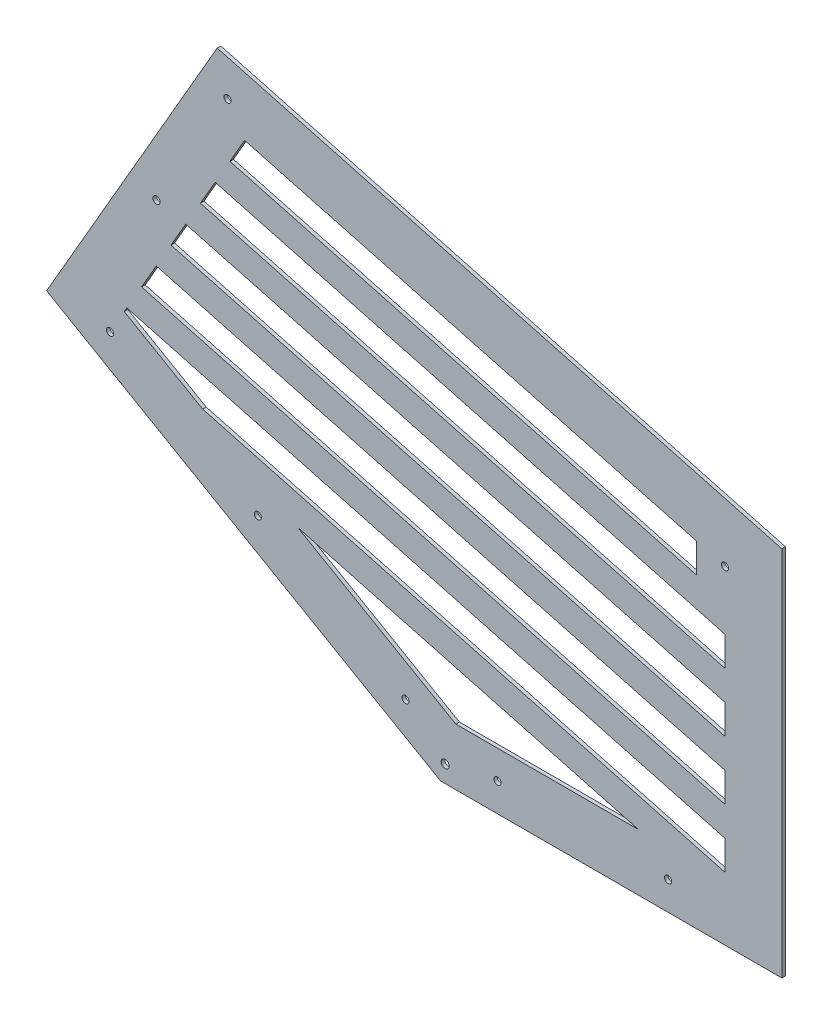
ISO-10303-21;
HEADER;
FILE_DESCRIPTION(('STEP AP214'),'2;1');
FILE_NAME('part.step','',(''),(''),'','','');
FILE_SCHEMA(('AUTOMOTIVE_DESIGN { 1 0 10303 214 1 1 1 1 }'));
ENDSEC;
DATA;
#1=APPLICATION_CONTEXT('core data for automotive mechanical design processes');
#2=APPLICATION_PROTOCOL_DEFINITION('international standard','automotive_design',2000,#1);
#3=PRODUCT_CONTEXT('',#1,'mechanical');
#4=PRODUCT('Part','Part','',(#3));
#5=PRODUCT_RELATED_PRODUCT_CATEGORY('part','',(#4));
#6=PRODUCT_DEFINITION_FORMATION('','',#4);
#7=PRODUCT_DEFINITION_CONTEXT('part definition',#1,'design');
#8=PRODUCT_DEFINITION('design','',#6,#7);
#9=PRODUCT_DEFINITION_SHAPE('','',#8);
#10=(LENGTH_UNIT() NAMED_UNIT(*) SI_UNIT(.MILLI.,.METRE.));
#11=(NAMED_UNIT(*) PLANE_ANGLE_UNIT() SI_UNIT($,.RADIAN.));
#12=(NAMED_UNIT(*) SI_UNIT($,.STERADIAN.) SOLID_ANGLE_UNIT());
#13=UNCERTAINTY_MEASURE_WITH_UNIT(LENGTH_MEASURE(1.E-05),#10,'distance_accuracy_value','');
#14=(GEOMETRIC_REPRESENTATION_CONTEXT(3) GLOBAL_UNCERTAINTY_ASSIGNED_CONTEXT((#13)) GLOBAL_UNIT_ASSIGNED_CONTEXT((#10,
#11,#12)) REPRESENTATION_CONTEXT('',''));
#15=CARTESIAN_POINT('',(0.,0.,0.));
#16=DIRECTION('',(0.,0.,1.));
#17=DIRECTION('',(1.,0.,0.));
#18=AXIS2_PLACEMENT_3D('',#15,#16,#17);
#19=CARTESIAN_POINT('',(0.,0.,1.5875));
#20=DIRECTION('',(0.,0.,-1.));
#21=DIRECTION('',(-1.,0.,0.));
#22=AXIS2_PLACEMENT_3D('',#19,#20,#21);
#23=PLANE('',#22);
#24=DIRECTION('',(0.,1.,0.));
#25=VECTOR('',#24,1.);
#26=CARTESIAN_POINT('',(127.,80.781676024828,1.5875));
#27=LINE('',#26,#25);
#28=CARTESIAN_POINT('',(127.,80.781676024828,1.5875));
#29=VERTEX_POINT('',#28);
#30=CARTESIAN_POINT('',(127.,93.9296835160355,1.5875));
#31=VERTEX_POINT('',#30);
#32=EDGE_CURVE('E279',#29,#31,#27,.T.);
#33=ORIENTED_EDGE('',*,*,#32,.F.);
#34=DIRECTION('',(0.965925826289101,-0.258819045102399,0.));
#35=VECTOR('',#34,1.);
#36=CARTESIAN_POINT('',(-120.394388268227,147.070802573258,1.5875));
#37=LINE('',#36,#35);
#38=CARTESIAN_POINT('',(-120.394388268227,147.070802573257,1.5875));
#39=VERTEX_POINT('',#38);
#40=EDGE_CURVE('E290',#39,#29,#37,.T.);
#41=ORIENTED_EDGE('',*,*,#40,.F.);
#42=DIRECTION('',(-0.499999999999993,-0.866025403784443,0.));
#43=VECTOR('',#42,1.);
#44=CARTESIAN_POINT('',(-113.820384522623,158.457311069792,1.5875));
#45=LINE('',#44,#43);
#46=CARTESIAN_POINT('',(-113.820384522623,158.457311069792,1.5875));
#47=VERTEX_POINT('',#46);
#48=EDGE_CURVE('E286',#47,#39,#45,.T.);
#49=ORIENTED_EDGE('',*,*,#48,.F.);
#50=DIRECTION('',(-0.965925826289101,0.258819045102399,0.));
#51=VECTOR('',#50,1.);
#52=CARTESIAN_POINT('',(-113.820384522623,158.457311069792,1.5875));
#53=LINE('',#52,#51);
#54=EDGE_CURVE('E282',#31,#47,#53,.T.);
#55=ORIENTED_EDGE('',*,*,#54,.F.);
#56=EDGE_LOOP('',(#33,#41,#49,#55));
#57=FACE_BOUND('',#56,.T.);
#58=CARTESIAN_POINT('',(-126.877839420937,161.241135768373,1.5875));
#59=DIRECTION('',(0.,0.,1.));
#60=DIRECTION('',(1.,0.,0.));
#61=AXIS2_PLACEMENT_3D('',#58,#59,#60);
#62=CIRCLE('',#61,1.58749999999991);
#63=CARTESIAN_POINT('',(-125.290339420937,161.241135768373,1.5875));
#64=VERTEX_POINT('',#63);
#65=EDGE_CURVE('E365',#64,#64,#62,.T.);
#66=ORIENTED_EDGE('',*,*,#65,.F.);
#67=EDGE_LOOP('',(#66));
#68=FACE_BOUND('',#67,.T.);
#69=CARTESIAN_POINT('',(-95.1278394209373,216.233748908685,1.5875));
#70=DIRECTION('',(0.,0.,1.));
#71=DIRECTION('',(1.,0.,0.));
#72=AXIS2_PLACEMENT_3D('',#69,#70,#71);
#73=CIRCLE('',#72,1.58749999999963);
#74=CARTESIAN_POINT('',(-93.5403394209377,216.233748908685,1.5875));
#75=VERTEX_POINT('',#74);
#76=EDGE_CURVE('E373',#75,#75,#73,.T.);
#77=ORIENTED_EDGE('',*,*,#76,.F.);
#78=EDGE_LOOP('',(#77));
#79=FACE_BOUND('',#78,.T.);
#80=CARTESIAN_POINT('',(-15.6470452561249,23.6985226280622,1.5875));
#81=DIRECTION('',(0.,0.,1.));
#82=DIRECTION('',(1.,0.,0.));
#83=AXIS2_PLACEMENT_3D('',#80,#81,#82);
#84=CIRCLE('',#83,1.58749999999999);
#85=CARTESIAN_POINT('',(-14.0595452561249,23.6985226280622,1.5875));
#86=VERTEX_POINT('',#85);
#87=EDGE_CURVE('E381',#86,#86,#84,.T.);
#88=ORIENTED_EDGE('',*,*,#87,.F.);
#89=EDGE_LOOP('',(#88));
#90=FACE_BOUND('',#89,.T.);
#91=CARTESIAN_POINT('',(-81.6381810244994,61.7985226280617,1.5875));
#92=DIRECTION('',(0.,0.,1.));
#93=DIRECTION('',(1.,0.,0.));
#94=AXIS2_PLACEMENT_3D('',#91,#92,#93);
#95=CIRCLE('',#94,1.58750000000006);
#96=CARTESIAN_POINT('',(-80.0506810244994,61.7985226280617,1.5875));
#97=VERTEX_POINT('',#96);
#98=EDGE_CURVE('E389',#97,#97,#95,.T.);
#99=ORIENTED_EDGE('',*,*,#98,.F.);
#100=EDGE_LOOP('',(#99));
#101=FACE_BOUND('',#100,.T.);
#102=CARTESIAN_POINT('',(-147.629316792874,99.8985226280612,1.5875));
#103=DIRECTION('',(0.,0.,1.));
#104=DIRECTION('',(1.,0.,0.));
#105=AXIS2_PLACEMENT_3D('',#102,#103,#104);
#106=CIRCLE('',#105,1.58750000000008);
#107=CARTESIAN_POINT('',(-146.041816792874,99.8985226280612,1.5875));
#108=VERTEX_POINT('',#107);
#109=EDGE_CURVE('E397',#108,#108,#106,.T.);
#110=ORIENTED_EDGE('',*,*,#109,.F.);
#111=EDGE_LOOP('',(#110));
#112=FACE_BOUND('',#111,.T.);
#113=CARTESIAN_POINT('',(25.3999999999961,12.7,1.5875));
#114=DIRECTION('',(0.,0.,1.));
#115=DIRECTION('',(1.,0.,0.));
#116=AXIS2_PLACEMENT_3D('',#113,#114,#115);
#117=CIRCLE('',#116,1.5875);
#118=CARTESIAN_POINT('',(26.9874999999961,12.7,1.5875));
#119=VERTEX_POINT('',#118);
#120=EDGE_CURVE('E405',#119,#119,#117,.T.);
#121=ORIENTED_EDGE('',*,*,#120,.F.);
#122=EDGE_LOOP('',(#121));
#123=FACE_BOUND('',#122,.T.);
#124=CARTESIAN_POINT('',(101.6,12.7,1.5875));
#125=DIRECTION('',(0.,0.,1.));
#126=DIRECTION('',(1.,0.,0.));
#127=AXIS2_PLACEMENT_3D('',#124,#125,#126);
#128=CIRCLE('',#127,1.5875);
#129=CARTESIAN_POINT('',(103.1875,12.7,1.5875));
#130=VERTEX_POINT('',#129);
#131=EDGE_CURVE('E413',#130,#130,#128,.T.);
#132=ORIENTED_EDGE('',*,*,#131,.F.);
#133=EDGE_LOOP('',(#132));
#134=FACE_BOUND('',#133,.T.);
#135=DIRECTION('',(0.866025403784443,-0.499999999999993,0.));
#136=VECTOR('',#135,1.);
#137=CARTESIAN_POINT('',(-63.8064758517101,66.1680796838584,1.5875));
#138=LINE('',#137,#136);
#139=CARTESIAN_POINT('',(-63.8064758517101,66.1680796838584,1.5875));
#140=VERTEX_POINT('',#139);
#141=CARTESIAN_POINT('',(6.80590948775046,25.4,1.5875));
#142=VERTEX_POINT('',#141);
#143=EDGE_CURVE('E421',#140,#142,#138,.T.);
#144=ORIENTED_EDGE('',*,*,#143,.F.);
#145=DIRECTION('',(-0.965925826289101,0.258819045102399,0.));
#146=VECTOR('',#145,1.);
#147=CARTESIAN_POINT('',(-63.8064758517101,66.1680796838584,1.5875));
#148=LINE('',#147,#146);
#149=CARTESIAN_POINT('',(88.3420688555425,25.4,1.5875));
#150=VERTEX_POINT('',#149);
#151=EDGE_CURVE('E429',#150,#140,#148,.T.);
#152=ORIENTED_EDGE('',*,*,#151,.F.);
#153=DIRECTION('',(1.,0.,0.));
#154=VECTOR('',#153,1.);
#155=CARTESIAN_POINT('',(6.80590948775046,25.4,1.5875));
#156=LINE('',#155,#154);
#157=EDGE_CURVE('E424',#142,#150,#156,.T.);
#158=ORIENTED_EDGE('',*,*,#157,.F.);
#159=EDGE_LOOP('',(#144,#152,#158));
#160=FACE_BOUND('',#159,.T.);
#161=DIRECTION('',(-0.9659258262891,0.258819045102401,0.));
#162=VECTOR('',#161,1.);
#163=CARTESIAN_POINT('',(114.3,149.924668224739,1.5875));
#164=LINE('',#163,#162);
#165=CARTESIAN_POINT('',(114.3,149.924668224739,1.5875));
#166=VERTEX_POINT('',#165);
#167=CARTESIAN_POINT('',(-87.5243695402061,204.003345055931,1.5875));
#168=VERTEX_POINT('',#167);
#169=EDGE_CURVE('E507',#166,#168,#164,.T.);
#170=ORIENTED_EDGE('',*,*,#169,.F.);
#171=DIRECTION('',(0.,1.,0.));
#172=VECTOR('',#171,1.);
#173=CARTESIAN_POINT('',(114.3,149.924668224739,1.5875));
#174=LINE('',#173,#172);
#175=CARTESIAN_POINT('',(114.3,136.776660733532,1.5875));
#176=VERTEX_POINT('',#175);
#177=EDGE_CURVE('E518',#176,#166,#174,.T.);
#178=ORIENTED_EDGE('',*,*,#177,.F.);
#179=DIRECTION('',(0.965925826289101,-0.258819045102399,0.));
#180=VECTOR('',#179,1.);
#181=CARTESIAN_POINT('',(-94.0983732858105,192.616836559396,1.5875));
#182=LINE('',#181,#180);
#183=CARTESIAN_POINT('',(-94.0983732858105,192.616836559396,1.5875));
#184=VERTEX_POINT('',#183);
#185=EDGE_CURVE('E514',#184,#176,#182,.T.);
#186=ORIENTED_EDGE('',*,*,#185,.F.);
#187=DIRECTION('',(-0.499999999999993,-0.866025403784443,0.));
#188=VECTOR('',#187,1.);
#189=CARTESIAN_POINT('',(-87.5243695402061,204.003345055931,1.5875));
#190=LINE('',#189,#188);
#191=EDGE_CURVE('E510',#168,#184,#190,.T.);
#192=ORIENTED_EDGE('',*,*,#191,.F.);
#193=EDGE_LOOP('',(#170,#178,#186,#192));
#194=FACE_BOUND('',#193,.T.);
#195=DIRECTION('',(0.866025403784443,-0.499999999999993,0.));
#196=VECTOR('',#195,1.);
#197=CARTESIAN_POINT('',(0.,0.,1.5875));
#198=LINE('',#197,#196);
#199=CARTESIAN_POINT('',(-175.976362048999,101.599999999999,1.5875));
#200=VERTEX_POINT('',#199);
#201=CARTESIAN_POINT('',(0.,0.,1.5875));
#202=VERTEX_POINT('',#201);
#203=EDGE_CURVE('E566',#200,#202,#198,.T.);
#204=ORIENTED_EDGE('',*,*,#203,.T.);
#205=DIRECTION('',(1.,0.,0.));
#206=VECTOR('',#205,1.);
#207=CARTESIAN_POINT('',(0.,0.,1.5875));
#208=LINE('',#207,#206);
#209=CARTESIAN_POINT('',(152.4,0.,1.5875));
#210=VERTEX_POINT('',#209);
#211=EDGE_CURVE('E570',#202,#210,#208,.T.);
#212=ORIENTED_EDGE('',*,*,#211,.T.);
#213=DIRECTION('',(0.,1.,0.));
#214=VECTOR('',#213,1.);
#215=CARTESIAN_POINT('',(152.4,0.,1.5875));
#216=LINE('',#215,#214);
#217=CARTESIAN_POINT('',(152.4,166.011818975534,1.5875));
#218=VERTEX_POINT('',#217);
#219=EDGE_CURVE('E574',#210,#218,#216,.T.);
#220=ORIENTED_EDGE('',*,*,#219,.T.);
#221=DIRECTION('',(-0.965925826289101,0.258819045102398,0.));
#222=VECTOR('',#221,1.);
#223=CARTESIAN_POINT('',(152.4,166.011818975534,1.5875));
#224=LINE('',#223,#222);
#225=CARTESIAN_POINT('',(-99.7763620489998,233.582271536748,1.5875));
#226=VERTEX_POINT('',#225);
#227=EDGE_CURVE('E577',#218,#226,#224,.T.);
#228=ORIENTED_EDGE('',*,*,#227,.T.);
#229=DIRECTION('',(-0.499999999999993,-0.866025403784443,0.));
#230=VECTOR('',#229,1.);
#231=CARTESIAN_POINT('',(-175.976362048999,101.599999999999,1.5875));
#232=LINE('',#231,#230);
#233=EDGE_CURVE('E580',#226,#200,#232,.T.);
#234=ORIENTED_EDGE('',*,*,#233,.T.);
#235=EDGE_LOOP('',(#204,#212,#220,#228,#234));
#236=FACE_BOUND('',#235,.T.);
#237=CARTESIAN_POINT('',(127.,146.521713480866,1.5875));
#238=DIRECTION('',(0.,0.,1.));
#239=DIRECTION('',(1.,0.,0.));
#240=AXIS2_PLACEMENT_3D('',#237,#238,#239);
#241=CIRCLE('',#240,1.58749999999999);
#242=CARTESIAN_POINT('',(128.5875,146.521713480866,1.5875));
#243=VERTEX_POINT('',#242);
#244=EDGE_CURVE('E558',#243,#243,#241,.T.);
#245=ORIENTED_EDGE('',*,*,#244,.F.);
#246=EDGE_LOOP('',(#245));
#247=FACE_BOUND('',#246,.T.);
#248=CARTESIAN_POINT('',(2.04177284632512,7.62,1.5875));
#249=DIRECTION('',(0.,0.,1.));
#250=DIRECTION('',(1.,0.,0.));
#251=AXIS2_PLACEMENT_3D('',#248,#249,#250);
#252=CIRCLE('',#251,1.7859375);
#253=CARTESIAN_POINT('',(3.82771034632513,7.62,1.5875));
#254=VERTEX_POINT('',#253);
#255=EDGE_CURVE('E550',#254,#254,#252,.T.);
#256=ORIENTED_EDGE('',*,*,#255,.F.);
#257=EDGE_LOOP('',(#256));
#258=FACE_BOUND('',#257,.T.);
#259=DIRECTION('',(-0.49999999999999,-0.866025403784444,0.));
#260=VECTOR('',#259,1.);
#261=CARTESIAN_POINT('',(-140.116399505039,112.911277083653,1.5875));
#262=LINE('',#261,#260);
#263=CARTESIAN_POINT('',(-140.116399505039,112.911277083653,1.5875));
#264=VERTEX_POINT('',#263);
#265=CARTESIAN_POINT('',(-141.279316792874,110.897045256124,1.5875));
#266=VERTEX_POINT('',#265);
#267=EDGE_CURVE('E454',#264,#266,#262,.T.);
#268=ORIENTED_EDGE('',*,*,#267,.F.);
#269=DIRECTION('',(-0.965925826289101,0.258819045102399,0.));
#270=VECTOR('',#269,1.);
#271=CARTESIAN_POINT('',(-140.116399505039,112.911277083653,1.5875));
#272=LINE('',#271,#270);
#273=CARTESIAN_POINT('',(127.,41.3376535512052,1.5875));
#274=VERTEX_POINT('',#273);
#275=EDGE_CURVE('E468',#274,#264,#272,.T.);
#276=ORIENTED_EDGE('',*,*,#275,.F.);
#277=DIRECTION('',(0.,1.,0.));
#278=VECTOR('',#277,1.);
#279=CARTESIAN_POINT('',(127.,28.1896460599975,1.5875));
#280=LINE('',#279,#278);
#281=CARTESIAN_POINT('',(127.,28.1896460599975,1.5875));
#282=VERTEX_POINT('',#281);
#283=EDGE_CURVE('E464',#282,#274,#280,.T.);
#284=ORIENTED_EDGE('',*,*,#283,.F.);
#285=DIRECTION('',(0.965925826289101,-0.258819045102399,0.));
#286=VECTOR('',#285,1.);
#287=CARTESIAN_POINT('',(-106.301504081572,90.7025956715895,1.5875));
#288=LINE('',#287,#286);
#289=CARTESIAN_POINT('',(-106.301504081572,90.7025956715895,1.5875));
#290=VERTEX_POINT('',#289);
#291=EDGE_CURVE('E461',#290,#282,#288,.T.);
#292=ORIENTED_EDGE('',*,*,#291,.F.);
#293=DIRECTION('',(0.866025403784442,-0.499999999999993,0.));
#294=VECTOR('',#293,1.);
#295=CARTESIAN_POINT('',(-141.279316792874,110.897045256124,1.5875));
#296=LINE('',#295,#294);
#297=EDGE_CURVE('E457',#266,#290,#296,.T.);
#298=ORIENTED_EDGE('',*,*,#297,.F.);
#299=EDGE_LOOP('',(#268,#276,#284,#292,#298));
#300=FACE_BOUND('',#299,.T.);
#301=DIRECTION('',(-0.499999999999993,-0.866025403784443,0.));
#302=VECTOR('',#301,1.);
#303=CARTESIAN_POINT('',(-100.672377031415,181.230328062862,1.5875));
#304=LINE('',#303,#302);
#305=CARTESIAN_POINT('',(-100.672377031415,181.230328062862,1.5875));
#306=VERTEX_POINT('',#305);
#307=CARTESIAN_POINT('',(-107.246380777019,169.843819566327,1.5875));
#308=VERTEX_POINT('',#307);
#309=EDGE_CURVE('E322',#306,#308,#304,.T.);
#310=ORIENTED_EDGE('',*,*,#309,.F.);
#311=DIRECTION('',(-0.965925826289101,0.258819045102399,0.));
#312=VECTOR('',#311,1.);
#313=CARTESIAN_POINT('',(-100.672377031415,181.230328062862,1.5875));
#314=LINE('',#313,#312);
#315=CARTESIAN_POINT('',(127.,120.225698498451,1.5875));
#316=VERTEX_POINT('',#315);
#317=EDGE_CURVE('E333',#316,#306,#314,.T.);
#318=ORIENTED_EDGE('',*,*,#317,.F.);
#319=DIRECTION('',(0.,1.,0.));
#320=VECTOR('',#319,1.);
#321=CARTESIAN_POINT('',(127.,107.077691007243,1.5875));
#322=LINE('',#321,#320);
#323=CARTESIAN_POINT('',(127.,107.077691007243,1.5875));
#324=VERTEX_POINT('',#323);
#325=EDGE_CURVE('E329',#324,#316,#322,.T.);
#326=ORIENTED_EDGE('',*,*,#325,.F.);
#327=DIRECTION('',(0.965925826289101,-0.258819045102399,0.));
#328=VECTOR('',#327,1.);
#329=CARTESIAN_POINT('',(-107.246380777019,169.843819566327,1.5875));
#330=LINE('',#329,#328);
#331=EDGE_CURVE('E325',#308,#324,#330,.T.);
#332=ORIENTED_EDGE('',*,*,#331,.F.);
#333=EDGE_LOOP('',(#310,#318,#326,#332));
#334=FACE_BOUND('',#333,.T.);
#335=DIRECTION('',(0.,1.,0.));
#336=VECTOR('',#335,1.);
#337=CARTESIAN_POINT('',(127.,54.4856610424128,1.5875));
#338=LINE('',#337,#336);
#339=CARTESIAN_POINT('',(127.,54.4856610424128,1.5875));
#340=VERTEX_POINT('',#339);
#341=CARTESIAN_POINT('',(127.,67.6336685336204,1.5875));
#342=VERTEX_POINT('',#341);
#343=EDGE_CURVE('E231',#340,#342,#338,.T.);
#344=ORIENTED_EDGE('',*,*,#343,.F.);
#345=DIRECTION('',(0.965925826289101,-0.258819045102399,0.));
#346=VECTOR('',#345,1.);
#347=CARTESIAN_POINT('',(-133.542395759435,124.297785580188,1.5875));
#348=LINE('',#347,#346);
#349=CARTESIAN_POINT('',(-133.542395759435,124.297785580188,1.5875));
#350=VERTEX_POINT('',#349);
#351=EDGE_CURVE('E257',#350,#340,#348,.T.);
#352=ORIENTED_EDGE('',*,*,#351,.F.);
#353=DIRECTION('',(-0.499999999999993,-0.866025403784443,0.));
#354=VECTOR('',#353,1.);
#355=CARTESIAN_POINT('',(-126.968392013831,135.684294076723,1.5875));
#356=LINE('',#355,#354);
#357=CARTESIAN_POINT('',(-126.968392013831,135.684294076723,1.5875));
#358=VERTEX_POINT('',#357);
#359=EDGE_CURVE('E253',#358,#350,#356,.T.);
#360=ORIENTED_EDGE('',*,*,#359,.F.);
#361=DIRECTION('',(-0.965925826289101,0.258819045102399,0.));
#362=VECTOR('',#361,1.);
#363=CARTESIAN_POINT('',(-126.968392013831,135.684294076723,1.5875));
#364=LINE('',#363,#362);
#365=EDGE_CURVE('E240',#342,#358,#364,.T.);
#366=ORIENTED_EDGE('',*,*,#365,.F.);
#367=EDGE_LOOP('',(#344,#352,#360,#366));
#368=FACE_BOUND('',#367,.T.);
#369=ADVANCED_FACE('F39',(#57,#68,#79,#90,#101,#112,#123,#134,#160,#194,#236,#247,#258,#300,
#334,#368),#23,.F.);
#370=CARTESIAN_POINT('',(0.,0.,0.));
#371=DIRECTION('',(0.,0.,-1.));
#372=DIRECTION('',(-1.,0.,0.));
#373=AXIS2_PLACEMENT_3D('',#370,#371,#372);
#374=PLANE('',#373);
#375=CARTESIAN_POINT('',(-95.1278394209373,216.233748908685,0.));
#376=DIRECTION('',(0.,0.,1.));
#377=DIRECTION('',(1.,0.,0.));
#378=AXIS2_PLACEMENT_3D('',#375,#376,#377);
#379=CIRCLE('',#378,1.58749999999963);
#380=CARTESIAN_POINT('',(-93.5403394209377,216.233748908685,0.));
#381=VERTEX_POINT('',#380);
#382=EDGE_CURVE('E369',#381,#381,#379,.T.);
#383=ORIENTED_EDGE('',*,*,#382,.T.);
#384=EDGE_LOOP('',(#383));
#385=FACE_BOUND('',#384,.T.);
#386=CARTESIAN_POINT('',(-81.6381810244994,61.7985226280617,0.));
#387=DIRECTION('',(0.,0.,1.));
#388=DIRECTION('',(1.,0.,0.));
#389=AXIS2_PLACEMENT_3D('',#386,#387,#388);
#390=CIRCLE('',#389,1.58750000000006);
#391=CARTESIAN_POINT('',(-80.0506810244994,61.7985226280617,0.));
#392=VERTEX_POINT('',#391);
#393=EDGE_CURVE('E385',#392,#392,#390,.T.);
#394=ORIENTED_EDGE('',*,*,#393,.T.);
#395=EDGE_LOOP('',(#394));
#396=FACE_BOUND('',#395,.T.);
#397=CARTESIAN_POINT('',(25.3999999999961,12.7,0.));
#398=DIRECTION('',(0.,0.,1.));
#399=DIRECTION('',(1.,0.,0.));
#400=AXIS2_PLACEMENT_3D('',#397,#398,#399);
#401=CIRCLE('',#400,1.5875);
#402=CARTESIAN_POINT('',(26.9874999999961,12.7,0.));
#403=VERTEX_POINT('',#402);
#404=EDGE_CURVE('E401',#403,#403,#401,.T.);
#405=ORIENTED_EDGE('',*,*,#404,.T.);
#406=EDGE_LOOP('',(#405));
#407=FACE_BOUND('',#406,.T.);
#408=DIRECTION('',(-0.965925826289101,0.258819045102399,0.));
#409=VECTOR('',#408,1.);
#410=CARTESIAN_POINT('',(-63.8064758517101,66.1680796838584,0.));
#411=LINE('',#410,#409);
#412=CARTESIAN_POINT('',(88.3420688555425,25.4,0.));
#413=VERTEX_POINT('',#412);
#414=CARTESIAN_POINT('',(-63.8064758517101,66.1680796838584,0.));
#415=VERTEX_POINT('',#414);
#416=EDGE_CURVE('E425',#413,#415,#411,.T.);
#417=ORIENTED_EDGE('',*,*,#416,.T.);
#418=DIRECTION('',(0.866025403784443,-0.499999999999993,0.));
#419=VECTOR('',#418,1.);
#420=CARTESIAN_POINT('',(-63.8064758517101,66.1680796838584,0.));
#421=LINE('',#420,#419);
#422=CARTESIAN_POINT('',(6.80590948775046,25.4,0.));
#423=VERTEX_POINT('',#422);
#424=EDGE_CURVE('E417',#415,#423,#421,.T.);
#425=ORIENTED_EDGE('',*,*,#424,.T.);
#426=DIRECTION('',(1.,0.,0.));
#427=VECTOR('',#426,1.);
#428=CARTESIAN_POINT('',(6.80590948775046,25.4,0.));
#429=LINE('',#428,#427);
#430=EDGE_CURVE('E436',#423,#413,#429,.T.);
#431=ORIENTED_EDGE('',*,*,#430,.T.);
#432=EDGE_LOOP('',(#417,#425,#431));
#433=FACE_BOUND('',#432,.T.);
#434=DIRECTION('',(-0.965925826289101,0.258819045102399,0.));
#435=VECTOR('',#434,1.);
#436=CARTESIAN_POINT('',(-140.116399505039,112.911277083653,0.));
#437=LINE('',#436,#435);
#438=CARTESIAN_POINT('',(127.,41.3376535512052,0.));
#439=VERTEX_POINT('',#438);
#440=CARTESIAN_POINT('',(-140.116399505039,112.911277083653,0.));
#441=VERTEX_POINT('',#440);
#442=EDGE_CURVE('E458',#439,#441,#437,.T.);
#443=ORIENTED_EDGE('',*,*,#442,.T.);
#444=DIRECTION('',(-0.49999999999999,-0.866025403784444,0.));
#445=VECTOR('',#444,1.);
#446=CARTESIAN_POINT('',(-140.116399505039,112.911277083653,0.));
#447=LINE('',#446,#445);
#448=CARTESIAN_POINT('',(-141.279316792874,110.897045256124,0.));
#449=VERTEX_POINT('',#448);
#450=EDGE_CURVE('E453',#441,#449,#447,.T.);
#451=ORIENTED_EDGE('',*,*,#450,.T.);
#452=DIRECTION('',(0.866025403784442,-0.499999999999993,0.));
#453=VECTOR('',#452,1.);
#454=CARTESIAN_POINT('',(-141.279316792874,110.897045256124,0.));
#455=LINE('',#454,#453);
#456=CARTESIAN_POINT('',(-106.301504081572,90.7025956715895,0.));
#457=VERTEX_POINT('',#456);
#458=EDGE_CURVE('E475',#449,#457,#455,.T.);
#459=ORIENTED_EDGE('',*,*,#458,.T.);
#460=DIRECTION('',(0.965925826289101,-0.258819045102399,0.));
#461=VECTOR('',#460,1.);
#462=CARTESIAN_POINT('',(-106.301504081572,90.7025956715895,0.));
#463=LINE('',#462,#461);
#464=CARTESIAN_POINT('',(127.,28.1896460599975,0.));
#465=VERTEX_POINT('',#464);
#466=EDGE_CURVE('E479',#457,#465,#463,.T.);
#467=ORIENTED_EDGE('',*,*,#466,.T.);
#468=DIRECTION('',(0.,1.,0.));
#469=VECTOR('',#468,1.);
#470=CARTESIAN_POINT('',(127.,28.1896460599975,0.));
#471=LINE('',#470,#469);
#472=EDGE_CURVE('E483',#465,#439,#471,.T.);
#473=ORIENTED_EDGE('',*,*,#472,.T.);
#474=EDGE_LOOP('',(#443,#451,#459,#467,#473));
#475=FACE_BOUND('',#474,.T.);
#476=DIRECTION('',(0.,1.,0.));
#477=VECTOR('',#476,1.);
#478=CARTESIAN_POINT('',(114.3,149.924668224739,0.));
#479=LINE('',#478,#477);
#480=CARTESIAN_POINT('',(114.3,136.776660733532,0.));
#481=VERTEX_POINT('',#480);
#482=CARTESIAN_POINT('',(114.3,149.924668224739,0.));
#483=VERTEX_POINT('',#482);
#484=EDGE_CURVE('E511',#481,#483,#479,.T.);
#485=ORIENTED_EDGE('',*,*,#484,.T.);
#486=DIRECTION('',(-0.9659258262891,0.258819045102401,0.));
#487=VECTOR('',#486,1.);
#488=CARTESIAN_POINT('',(114.3,149.924668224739,0.));
#489=LINE('',#488,#487);
#490=CARTESIAN_POINT('',(-87.5243695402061,204.003345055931,0.));
#491=VERTEX_POINT('',#490);
#492=EDGE_CURVE('E506',#483,#491,#489,.T.);
#493=ORIENTED_EDGE('',*,*,#492,.T.);
#494=DIRECTION('',(-0.499999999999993,-0.866025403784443,0.));
#495=VECTOR('',#494,1.);
#496=CARTESIAN_POINT('',(-87.5243695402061,204.003345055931,0.));
#497=LINE('',#496,#495);
#498=CARTESIAN_POINT('',(-94.0983732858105,192.616836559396,0.));
#499=VERTEX_POINT('',#498);
#500=EDGE_CURVE('E525',#491,#499,#497,.T.);
#501=ORIENTED_EDGE('',*,*,#500,.T.);
#502=DIRECTION('',(0.965925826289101,-0.258819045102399,0.));
#503=VECTOR('',#502,1.);
#504=CARTESIAN_POINT('',(-94.0983732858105,192.616836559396,0.));
#505=LINE('',#504,#503);
#506=EDGE_CURVE('E529',#499,#481,#505,.T.);
#507=ORIENTED_EDGE('',*,*,#506,.T.);
#508=EDGE_LOOP('',(#485,#493,#501,#507));
#509=FACE_BOUND('',#508,.T.);
#510=CARTESIAN_POINT('',(2.04177284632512,7.62,0.));
#511=DIRECTION('',(0.,0.,1.));
#512=DIRECTION('',(1.,0.,0.));
#513=AXIS2_PLACEMENT_3D('',#510,#511,#512);
#514=CIRCLE('',#513,1.7859375);
#515=CARTESIAN_POINT('',(3.82771034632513,7.62,0.));
#516=VERTEX_POINT('',#515);
#517=EDGE_CURVE('E549',#516,#516,#514,.T.);
#518=ORIENTED_EDGE('',*,*,#517,.T.);
#519=EDGE_LOOP('',(#518));
#520=FACE_BOUND('',#519,.T.);
#521=DIRECTION('',(0.866025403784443,-0.499999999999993,0.));
#522=VECTOR('',#521,1.);
#523=CARTESIAN_POINT('',(0.,0.,0.));
#524=LINE('',#523,#522);
#525=CARTESIAN_POINT('',(-175.976362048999,101.599999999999,0.));
#526=VERTEX_POINT('',#525);
#527=CARTESIAN_POINT('',(0.,0.,0.));
#528=VERTEX_POINT('',#527);
#529=EDGE_CURVE('E562',#526,#528,#524,.T.);
#530=ORIENTED_EDGE('',*,*,#529,.F.);
#531=DIRECTION('',(-0.499999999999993,-0.866025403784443,0.));
#532=VECTOR('',#531,1.);
#533=CARTESIAN_POINT('',(-175.976362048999,101.599999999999,0.));
#534=LINE('',#533,#532);
#535=CARTESIAN_POINT('',(-99.7763620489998,233.582271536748,0.));
#536=VERTEX_POINT('',#535);
#537=EDGE_CURVE('E571',#536,#526,#534,.T.);
#538=ORIENTED_EDGE('',*,*,#537,.F.);
#539=DIRECTION('',(-0.965925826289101,0.258819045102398,0.));
#540=VECTOR('',#539,1.);
#541=CARTESIAN_POINT('',(152.4,166.011818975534,0.));
#542=LINE('',#541,#540);
#543=CARTESIAN_POINT('',(152.4,166.011818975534,0.));
#544=VERTEX_POINT('',#543);
#545=EDGE_CURVE('E593',#544,#536,#542,.T.);
#546=ORIENTED_EDGE('',*,*,#545,.F.);
#547=DIRECTION('',(0.,1.,0.));
#548=VECTOR('',#547,1.);
#549=CARTESIAN_POINT('',(152.4,0.,0.));
#550=LINE('',#549,#548);
#551=CARTESIAN_POINT('',(152.4,0.,0.));
#552=VERTEX_POINT('',#551);
#553=EDGE_CURVE('E590',#552,#544,#550,.T.);
#554=ORIENTED_EDGE('',*,*,#553,.F.);
#555=DIRECTION('',(1.,0.,0.));
#556=VECTOR('',#555,1.);
#557=CARTESIAN_POINT('',(0.,0.,0.));
#558=LINE('',#557,#556);
#559=EDGE_CURVE('E587',#528,#552,#558,.T.);
#560=ORIENTED_EDGE('',*,*,#559,.F.);
#561=EDGE_LOOP('',(#530,#538,#546,#554,#560));
#562=FACE_BOUND('',#561,.T.);
#563=CARTESIAN_POINT('',(127.,146.521713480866,0.));
#564=DIRECTION('',(0.,0.,1.));
#565=DIRECTION('',(1.,0.,0.));
#566=AXIS2_PLACEMENT_3D('',#563,#564,#565);
#567=CIRCLE('',#566,1.58749999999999);
#568=CARTESIAN_POINT('',(128.5875,146.521713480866,0.));
#569=VERTEX_POINT('',#568);
#570=EDGE_CURVE('E554',#569,#569,#567,.T.);
#571=ORIENTED_EDGE('',*,*,#570,.T.);
#572=EDGE_LOOP('',(#571));
#573=FACE_BOUND('',#572,.T.);
#574=CARTESIAN_POINT('',(101.6,12.7,0.));
#575=DIRECTION('',(0.,0.,1.));
#576=DIRECTION('',(1.,0.,0.));
#577=AXIS2_PLACEMENT_3D('',#574,#575,#576);
#578=CIRCLE('',#577,1.5875);
#579=CARTESIAN_POINT('',(103.1875,12.7,0.));
#580=VERTEX_POINT('',#579);
#581=EDGE_CURVE('E409',#580,#580,#578,.T.);
#582=ORIENTED_EDGE('',*,*,#581,.T.);
#583=EDGE_LOOP('',(#582));
#584=FACE_BOUND('',#583,.T.);
#585=CARTESIAN_POINT('',(-147.629316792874,99.8985226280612,0.));
#586=DIRECTION('',(0.,0.,1.));
#587=DIRECTION('',(1.,0.,0.));
#588=AXIS2_PLACEMENT_3D('',#585,#586,#587);
#589=CIRCLE('',#588,1.58750000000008);
#590=CARTESIAN_POINT('',(-146.041816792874,99.8985226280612,0.));
#591=VERTEX_POINT('',#590);
#592=EDGE_CURVE('E393',#591,#591,#589,.T.);
#593=ORIENTED_EDGE('',*,*,#592,.T.);
#594=EDGE_LOOP('',(#593));
#595=FACE_BOUND('',#594,.T.);
#596=CARTESIAN_POINT('',(-15.6470452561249,23.6985226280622,0.));
#597=DIRECTION('',(0.,0.,1.));
#598=DIRECTION('',(1.,0.,0.));
#599=AXIS2_PLACEMENT_3D('',#596,#597,#598);
#600=CIRCLE('',#599,1.58749999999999);
#601=CARTESIAN_POINT('',(-14.0595452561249,23.6985226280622,0.));
#602=VERTEX_POINT('',#601);
#603=EDGE_CURVE('E377',#602,#602,#600,.T.);
#604=ORIENTED_EDGE('',*,*,#603,.T.);
#605=EDGE_LOOP('',(#604));
#606=FACE_BOUND('',#605,.T.);
#607=CARTESIAN_POINT('',(-126.877839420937,161.241135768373,0.));
#608=DIRECTION('',(0.,0.,1.));
#609=DIRECTION('',(1.,0.,0.));
#610=AXIS2_PLACEMENT_3D('',#607,#608,#609);
#611=CIRCLE('',#610,1.58749999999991);
#612=CARTESIAN_POINT('',(-125.290339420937,161.241135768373,0.));
#613=VERTEX_POINT('',#612);
#614=EDGE_CURVE('E364',#613,#613,#611,.T.);
#615=ORIENTED_EDGE('',*,*,#614,.T.);
#616=EDGE_LOOP('',(#615));
#617=FACE_BOUND('',#616,.T.);
#618=DIRECTION('',(-0.965925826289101,0.258819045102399,0.));
#619=VECTOR('',#618,1.);
#620=CARTESIAN_POINT('',(-100.672377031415,181.230328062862,0.));
#621=LINE('',#620,#619);
#622=CARTESIAN_POINT('',(127.,120.225698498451,0.));
#623=VERTEX_POINT('',#622);
#624=CARTESIAN_POINT('',(-100.672377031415,181.230328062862,0.));
#625=VERTEX_POINT('',#624);
#626=EDGE_CURVE('E326',#623,#625,#621,.T.);
#627=ORIENTED_EDGE('',*,*,#626,.T.);
#628=DIRECTION('',(-0.499999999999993,-0.866025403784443,0.));
#629=VECTOR('',#628,1.);
#630=CARTESIAN_POINT('',(-100.672377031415,181.230328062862,0.));
#631=LINE('',#630,#629);
#632=CARTESIAN_POINT('',(-107.246380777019,169.843819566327,0.));
#633=VERTEX_POINT('',#632);
#634=EDGE_CURVE('E321',#625,#633,#631,.T.);
#635=ORIENTED_EDGE('',*,*,#634,.T.);
#636=DIRECTION('',(0.965925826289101,-0.258819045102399,0.));
#637=VECTOR('',#636,1.);
#638=CARTESIAN_POINT('',(-107.246380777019,169.843819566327,0.));
#639=LINE('',#638,#637);
#640=CARTESIAN_POINT('',(127.,107.077691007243,0.));
#641=VERTEX_POINT('',#640);
#642=EDGE_CURVE('E340',#633,#641,#639,.T.);
#643=ORIENTED_EDGE('',*,*,#642,.T.);
#644=DIRECTION('',(0.,1.,0.));
#645=VECTOR('',#644,1.);
#646=CARTESIAN_POINT('',(127.,107.077691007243,0.));
#647=LINE('',#646,#645);
#648=EDGE_CURVE('E344',#641,#623,#647,.T.);
#649=ORIENTED_EDGE('',*,*,#648,.T.);
#650=EDGE_LOOP('',(#627,#635,#643,#649));
#651=FACE_BOUND('',#650,.T.);
#652=DIRECTION('',(0.965925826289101,-0.258819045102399,0.));
#653=VECTOR('',#652,1.);
#654=CARTESIAN_POINT('',(-120.394388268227,147.070802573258,0.));
#655=LINE('',#654,#653);
#656=CARTESIAN_POINT('',(-120.394388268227,147.070802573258,0.));
#657=VERTEX_POINT('',#656);
#658=CARTESIAN_POINT('',(127.,80.7816760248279,0.));
#659=VERTEX_POINT('',#658);
#660=EDGE_CURVE('E283',#657,#659,#655,.T.);
#661=ORIENTED_EDGE('',*,*,#660,.T.);
#662=DIRECTION('',(0.,1.,0.));
#663=VECTOR('',#662,1.);
#664=CARTESIAN_POINT('',(127.,80.781676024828,0.));
#665=LINE('',#664,#663);
#666=CARTESIAN_POINT('',(127.,93.9296835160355,0.));
#667=VERTEX_POINT('',#666);
#668=EDGE_CURVE('E249',#659,#667,#665,.T.);
#669=ORIENTED_EDGE('',*,*,#668,.T.);
#670=DIRECTION('',(-0.965925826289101,0.258819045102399,0.));
#671=VECTOR('',#670,1.);
#672=CARTESIAN_POINT('',(-113.820384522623,158.457311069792,0.));
#673=LINE('',#672,#671);
#674=CARTESIAN_POINT('',(-113.820384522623,158.457311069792,0.));
#675=VERTEX_POINT('',#674);
#676=EDGE_CURVE('E297',#667,#675,#673,.T.);
#677=ORIENTED_EDGE('',*,*,#676,.T.);
#678=DIRECTION('',(-0.499999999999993,-0.866025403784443,0.));
#679=VECTOR('',#678,1.);
#680=CARTESIAN_POINT('',(-113.820384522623,158.457311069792,0.));
#681=LINE('',#680,#679);
#682=EDGE_CURVE('E301',#675,#657,#681,.T.);
#683=ORIENTED_EDGE('',*,*,#682,.T.);
#684=EDGE_LOOP('',(#661,#669,#677,#683));
#685=FACE_BOUND('',#684,.T.);
#686=DIRECTION('',(0.965925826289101,-0.258819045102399,0.));
#687=VECTOR('',#686,1.);
#688=CARTESIAN_POINT('',(-133.542395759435,124.297785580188,0.));
#689=LINE('',#688,#687);
#690=CARTESIAN_POINT('',(-133.542395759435,124.297785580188,0.));
#691=VERTEX_POINT('',#690);
#692=CARTESIAN_POINT('',(127.,54.4856610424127,0.));
#693=VERTEX_POINT('',#692);
#694=EDGE_CURVE('E241',#691,#693,#689,.T.);
#695=ORIENTED_EDGE('',*,*,#694,.T.);
#696=DIRECTION('',(0.,1.,0.));
#697=VECTOR('',#696,1.);
#698=CARTESIAN_POINT('',(127.,54.4856610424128,0.));
#699=LINE('',#698,#697);
#700=CARTESIAN_POINT('',(127.,67.6336685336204,0.));
#701=VERTEX_POINT('',#700);
#702=EDGE_CURVE('E63',#693,#701,#699,.T.);
#703=ORIENTED_EDGE('',*,*,#702,.T.);
#704=DIRECTION('',(-0.965925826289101,0.258819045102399,0.));
#705=VECTOR('',#704,1.);
#706=CARTESIAN_POINT('',(-126.968392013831,135.684294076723,0.));
#707=LINE('',#706,#705);
#708=CARTESIAN_POINT('',(-126.968392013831,135.684294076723,0.));
#709=VERTEX_POINT('',#708);
#710=EDGE_CURVE('E247',#701,#709,#707,.T.);
#711=ORIENTED_EDGE('',*,*,#710,.T.);
#712=DIRECTION('',(-0.499999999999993,-0.866025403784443,0.));
#713=VECTOR('',#712,1.);
#714=CARTESIAN_POINT('',(-126.968392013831,135.684294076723,0.));
#715=LINE('',#714,#713);
#716=EDGE_CURVE('E266',#709,#691,#715,.T.);
#717=ORIENTED_EDGE('',*,*,#716,.T.);
#718=EDGE_LOOP('',(#695,#703,#711,#717));
#719=FACE_BOUND('',#718,.T.);
#720=ADVANCED_FACE('F620',(#385,#396,#407,#433,#475,#509,#520,#562,#573,#584,#595,#606,#617,
#651,#685,#719),#374,.T.);
#721=CARTESIAN_POINT('',(0.,0.,1.5875));
#722=DIRECTION('',(0.499999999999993,0.866025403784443,0.));
#723=DIRECTION('',(-0.866025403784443,0.499999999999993,0.));
#724=AXIS2_PLACEMENT_3D('',#721,#722,#723);
#725=PLANE('',#724);
#726=ORIENTED_EDGE('',*,*,#529,.T.);
#727=DIRECTION('',(0.,0.,-1.));
#728=VECTOR('',#727,1.);
#729=CARTESIAN_POINT('',(0.,0.,1.5875));
#730=LINE('',#729,#728);
#731=EDGE_CURVE('E11',#202,#528,#730,.T.);
#732=ORIENTED_EDGE('',*,*,#731,.F.);
#733=ORIENTED_EDGE('',*,*,#203,.F.);
#734=DIRECTION('',(0.,0.,-1.));
#735=VECTOR('',#734,1.);
#736=CARTESIAN_POINT('',(-175.976362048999,101.599999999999,1.5875));
#737=LINE('',#736,#735);
#738=EDGE_CURVE('E583',#200,#526,#737,.T.);
#739=ORIENTED_EDGE('',*,*,#738,.T.);
#740=EDGE_LOOP('',(#726,#732,#733,#739));
#741=FACE_BOUND('',#740,.T.);
#742=ADVANCED_FACE('F41',(#741),#725,.F.);
#743=CARTESIAN_POINT('',(0.,0.,1.5875));
#744=DIRECTION('',(0.,1.,0.));
#745=DIRECTION('',(0.,0.,1.));
#746=AXIS2_PLACEMENT_3D('',#743,#744,#745);
#747=PLANE('',#746);
#748=ORIENTED_EDGE('',*,*,#559,.T.);
#749=DIRECTION('',(0.,0.,-1.));
#750=VECTOR('',#749,1.);
#751=CARTESIAN_POINT('',(152.4,0.,1.5875));
#752=LINE('',#751,#750);
#753=EDGE_CURVE('E48',#210,#552,#752,.T.);
#754=ORIENTED_EDGE('',*,*,#753,.F.);
#755=ORIENTED_EDGE('',*,*,#211,.F.);
#756=ORIENTED_EDGE('',*,*,#731,.T.);
#757=EDGE_LOOP('',(#748,#754,#755,#756));
#758=FACE_BOUND('',#757,.T.);
#759=ADVANCED_FACE('F635',(#758),#747,.F.);
#760=CARTESIAN_POINT('',(152.4,0.,1.5875));
#761=DIRECTION('',(-1.,0.,0.));
#762=DIRECTION('',(0.,0.,1.));
#763=AXIS2_PLACEMENT_3D('',#760,#761,#762);
#764=PLANE('',#763);
#765=ORIENTED_EDGE('',*,*,#553,.T.);
#766=DIRECTION('',(0.,0.,-1.));
#767=VECTOR('',#766,1.);
#768=CARTESIAN_POINT('',(152.4,166.011818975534,1.5875));
#769=LINE('',#768,#767);
#770=EDGE_CURVE('E605',#218,#544,#769,.T.);
#771=ORIENTED_EDGE('',*,*,#770,.F.);
#772=ORIENTED_EDGE('',*,*,#219,.F.);
#773=ORIENTED_EDGE('',*,*,#753,.T.);
#774=EDGE_LOOP('',(#765,#771,#772,#773));
#775=FACE_BOUND('',#774,.T.);
#776=ADVANCED_FACE('F614',(#775),#764,.F.);
#777=CARTESIAN_POINT('',(152.4,166.011818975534,1.5875));
#778=DIRECTION('',(-0.258819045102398,-0.965925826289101,0.));
#779=DIRECTION('',(0.965925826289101,-0.258819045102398,0.));
#780=AXIS2_PLACEMENT_3D('',#777,#778,#779);
#781=PLANE('',#780);
#782=ORIENTED_EDGE('',*,*,#545,.T.);
#783=DIRECTION('',(0.,0.,-1.));
#784=VECTOR('',#783,1.);
#785=CARTESIAN_POINT('',(-99.7763620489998,233.582271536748,1.5875));
#786=LINE('',#785,#784);
#787=EDGE_CURVE('E601',#226,#536,#786,.T.);
#788=ORIENTED_EDGE('',*,*,#787,.F.);
#789=ORIENTED_EDGE('',*,*,#227,.F.);
#790=ORIENTED_EDGE('',*,*,#770,.T.);
#791=EDGE_LOOP('',(#782,#788,#789,#790));
#792=FACE_BOUND('',#791,.T.);
#793=ADVANCED_FACE('F625',(#792),#781,.F.);
#794=CARTESIAN_POINT('',(-175.976362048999,101.599999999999,1.5875));
#795=DIRECTION('',(0.866025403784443,-0.499999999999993,0.));
#796=DIRECTION('',(0.499999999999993,0.866025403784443,0.));
#797=AXIS2_PLACEMENT_3D('',#794,#795,#796);
#798=PLANE('',#797);
#799=ORIENTED_EDGE('',*,*,#537,.T.);
#800=ORIENTED_EDGE('',*,*,#738,.F.);
#801=ORIENTED_EDGE('',*,*,#233,.F.);
#802=ORIENTED_EDGE('',*,*,#787,.T.);
#803=EDGE_LOOP('',(#799,#800,#801,#802));
#804=FACE_BOUND('',#803,.T.);
#805=ADVANCED_FACE('F629',(#804),#798,.F.);
#806=CARTESIAN_POINT('',(127.,146.521713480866,1.5875));
#807=DIRECTION('',(0.,0.,-1.));
#808=DIRECTION('',(-1.,0.,0.));
#809=AXIS2_PLACEMENT_3D('',#806,#807,#808);
#810=CYLINDRICAL_SURFACE('',#809,1.58749999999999);
#811=ORIENTED_EDGE('',*,*,#244,.T.);
#812=EDGE_LOOP('',(#811));
#813=FACE_BOUND('',#812,.T.);
#814=ORIENTED_EDGE('',*,*,#570,.F.);
#815=EDGE_LOOP('',(#814));
#816=FACE_BOUND('',#815,.T.);
#817=ADVANCED_FACE('F652',(#813,#816),#810,.F.);
#818=CARTESIAN_POINT('',(2.04177284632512,7.62,1.5875));
#819=DIRECTION('',(0.,0.,-1.));
#820=DIRECTION('',(-1.,0.,0.));
#821=AXIS2_PLACEMENT_3D('',#818,#819,#820);
#822=CYLINDRICAL_SURFACE('',#821,1.7859375);
#823=ORIENTED_EDGE('',*,*,#255,.T.);
#824=EDGE_LOOP('',(#823));
#825=FACE_BOUND('',#824,.T.);
#826=ORIENTED_EDGE('',*,*,#517,.F.);
#827=EDGE_LOOP('',(#826));
#828=FACE_BOUND('',#827,.T.);
#829=ADVANCED_FACE('F678',(#825,#828),#822,.F.);
#830=CARTESIAN_POINT('',(114.3,149.924668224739,1.5875));
#831=DIRECTION('',(-0.258819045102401,-0.9659258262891,0.));
#832=DIRECTION('',(0.9659258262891,-0.258819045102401,0.));
#833=AXIS2_PLACEMENT_3D('',#830,#831,#832);
#834=PLANE('',#833);
#835=ORIENTED_EDGE('',*,*,#492,.F.);
#836=DIRECTION('',(0.,0.,-1.));
#837=VECTOR('',#836,1.);
#838=CARTESIAN_POINT('',(114.3,149.924668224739,1.5875));
#839=LINE('',#838,#837);
#840=EDGE_CURVE('E521',#166,#483,#839,.T.);
#841=ORIENTED_EDGE('',*,*,#840,.F.);
#842=ORIENTED_EDGE('',*,*,#169,.T.);
#843=DIRECTION('',(0.,0.,-1.));
#844=VECTOR('',#843,1.);
#845=CARTESIAN_POINT('',(-87.5243695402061,204.003345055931,1.5875));
#846=LINE('',#845,#844);
#847=EDGE_CURVE('E545',#168,#491,#846,.T.);
#848=ORIENTED_EDGE('',*,*,#847,.T.);
#849=EDGE_LOOP('',(#835,#841,#842,#848));
#850=FACE_BOUND('',#849,.T.);
#851=ADVANCED_FACE('F685',(#850),#834,.T.);
#852=CARTESIAN_POINT('',(-87.5243695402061,204.003345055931,1.5875));
#853=DIRECTION('',(0.866025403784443,-0.499999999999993,0.));
#854=DIRECTION('',(0.499999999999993,0.866025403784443,0.));
#855=AXIS2_PLACEMENT_3D('',#852,#853,#854);
#856=PLANE('',#855);
#857=ORIENTED_EDGE('',*,*,#500,.F.);
#858=ORIENTED_EDGE('',*,*,#847,.F.);
#859=ORIENTED_EDGE('',*,*,#191,.T.);
#860=DIRECTION('',(0.,0.,-1.));
#861=VECTOR('',#860,1.);
#862=CARTESIAN_POINT('',(-94.0983732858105,192.616836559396,1.5875));
#863=LINE('',#862,#861);
#864=EDGE_CURVE('E542',#184,#499,#863,.T.);
#865=ORIENTED_EDGE('',*,*,#864,.T.);
#866=EDGE_LOOP('',(#857,#858,#859,#865));
#867=FACE_BOUND('',#866,.T.);
#868=ADVANCED_FACE('F692',(#867),#856,.T.);
#869=CARTESIAN_POINT('',(-94.0983732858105,192.616836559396,1.5875));
#870=DIRECTION('',(0.258819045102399,0.965925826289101,0.));
#871=DIRECTION('',(-0.965925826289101,0.258819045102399,0.));
#872=AXIS2_PLACEMENT_3D('',#869,#870,#871);
#873=PLANE('',#872);
#874=ORIENTED_EDGE('',*,*,#506,.F.);
#875=ORIENTED_EDGE('',*,*,#864,.F.);
#876=ORIENTED_EDGE('',*,*,#185,.T.);
#877=DIRECTION('',(0.,0.,-1.));
#878=VECTOR('',#877,1.);
#879=CARTESIAN_POINT('',(114.3,136.776660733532,1.5875));
#880=LINE('',#879,#878);
#881=EDGE_CURVE('E539',#176,#481,#880,.T.);
#882=ORIENTED_EDGE('',*,*,#881,.T.);
#883=EDGE_LOOP('',(#874,#875,#876,#882));
#884=FACE_BOUND('',#883,.T.);
#885=ADVANCED_FACE('F700',(#884),#873,.T.);
#886=CARTESIAN_POINT('',(114.3,149.924668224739,1.5875));
#887=DIRECTION('',(-1.,0.,0.));
#888=DIRECTION('',(0.,0.,1.));
#889=AXIS2_PLACEMENT_3D('',#886,#887,#888);
#890=PLANE('',#889);
#891=ORIENTED_EDGE('',*,*,#484,.F.);
#892=ORIENTED_EDGE('',*,*,#881,.F.);
#893=ORIENTED_EDGE('',*,*,#177,.T.);
#894=ORIENTED_EDGE('',*,*,#840,.T.);
#895=EDGE_LOOP('',(#891,#892,#893,#894));
#896=FACE_BOUND('',#895,.T.);
#897=ADVANCED_FACE('F708',(#896),#890,.T.);
#898=CARTESIAN_POINT('',(-140.116399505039,112.911277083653,1.5875));
#899=DIRECTION('',(0.866025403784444,-0.49999999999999,0.));
#900=DIRECTION('',(0.49999999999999,0.866025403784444,0.));
#901=AXIS2_PLACEMENT_3D('',#898,#899,#900);
#902=PLANE('',#901);
#903=ORIENTED_EDGE('',*,*,#450,.F.);
#904=DIRECTION('',(0.,0.,-1.));
#905=VECTOR('',#904,1.);
#906=CARTESIAN_POINT('',(-140.116399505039,112.911277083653,1.5875));
#907=LINE('',#906,#905);
#908=EDGE_CURVE('E471',#264,#441,#907,.T.);
#909=ORIENTED_EDGE('',*,*,#908,.F.);
#910=ORIENTED_EDGE('',*,*,#267,.T.);
#911=DIRECTION('',(0.,0.,-1.));
#912=VECTOR('',#911,1.);
#913=CARTESIAN_POINT('',(-141.279316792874,110.897045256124,1.5875));
#914=LINE('',#913,#912);
#915=EDGE_CURVE('E502',#266,#449,#914,.T.);
#916=ORIENTED_EDGE('',*,*,#915,.T.);
#917=EDGE_LOOP('',(#903,#909,#910,#916));
#918=FACE_BOUND('',#917,.T.);
#919=ADVANCED_FACE('F716',(#918),#902,.T.);
#920=CARTESIAN_POINT('',(-141.279316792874,110.897045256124,1.5875));
#921=DIRECTION('',(0.499999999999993,0.866025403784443,0.));
#922=DIRECTION('',(-0.866025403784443,0.499999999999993,0.));
#923=AXIS2_PLACEMENT_3D('',#920,#921,#922);
#924=PLANE('',#923);
#925=ORIENTED_EDGE('',*,*,#458,.F.);
#926=ORIENTED_EDGE('',*,*,#915,.F.);
#927=ORIENTED_EDGE('',*,*,#297,.T.);
#928=DIRECTION('',(0.,0.,-1.));
#929=VECTOR('',#928,1.);
#930=CARTESIAN_POINT('',(-106.301504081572,90.7025956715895,1.5875));
#931=LINE('',#930,#929);
#932=EDGE_CURVE('E499',#290,#457,#931,.T.);
#933=ORIENTED_EDGE('',*,*,#932,.T.);
#934=EDGE_LOOP('',(#925,#926,#927,#933));
#935=FACE_BOUND('',#934,.T.);
#936=ADVANCED_FACE('F724',(#935),#924,.T.);
#937=CARTESIAN_POINT('',(-106.301504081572,90.7025956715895,1.5875));
#938=DIRECTION('',(0.258819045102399,0.965925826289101,0.));
#939=DIRECTION('',(-0.965925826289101,0.258819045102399,0.));
#940=AXIS2_PLACEMENT_3D('',#937,#938,#939);
#941=PLANE('',#940);
#942=ORIENTED_EDGE('',*,*,#466,.F.);
#943=ORIENTED_EDGE('',*,*,#932,.F.);
#944=ORIENTED_EDGE('',*,*,#291,.T.);
#945=DIRECTION('',(0.,0.,-1.));
#946=VECTOR('',#945,1.);
#947=CARTESIAN_POINT('',(127.,28.1896460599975,1.5875));
#948=LINE('',#947,#946);
#949=EDGE_CURVE('E496',#282,#465,#948,.T.);
#950=ORIENTED_EDGE('',*,*,#949,.T.);
#951=EDGE_LOOP('',(#942,#943,#944,#950));
#952=FACE_BOUND('',#951,.T.);
#953=ADVANCED_FACE('F732',(#952),#941,.T.);
#954=CARTESIAN_POINT('',(127.,28.1896460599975,1.5875));
#955=DIRECTION('',(-1.,0.,0.));
#956=DIRECTION('',(0.,0.,1.));
#957=AXIS2_PLACEMENT_3D('',#954,#955,#956);
#958=PLANE('',#957);
#959=ORIENTED_EDGE('',*,*,#472,.F.);
#960=ORIENTED_EDGE('',*,*,#949,.F.);
#961=ORIENTED_EDGE('',*,*,#283,.T.);
#962=DIRECTION('',(0.,0.,-1.));
#963=VECTOR('',#962,1.);
#964=CARTESIAN_POINT('',(127.,41.3376535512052,1.5875));
#965=LINE('',#964,#963);
#966=EDGE_CURVE('E493',#274,#439,#965,.T.);
#967=ORIENTED_EDGE('',*,*,#966,.T.);
#968=EDGE_LOOP('',(#959,#960,#961,#967));
#969=FACE_BOUND('',#968,.T.);
#970=ADVANCED_FACE('F740',(#969),#958,.T.);
#971=CARTESIAN_POINT('',(-140.116399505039,112.911277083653,1.5875));
#972=DIRECTION('',(-0.258819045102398,-0.965925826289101,0.));
#973=DIRECTION('',(0.965925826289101,-0.258819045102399,0.));
#974=AXIS2_PLACEMENT_3D('',#971,#972,#973);
#975=PLANE('',#974);
#976=ORIENTED_EDGE('',*,*,#442,.F.);
#977=ORIENTED_EDGE('',*,*,#966,.F.);
#978=ORIENTED_EDGE('',*,*,#275,.T.);
#979=ORIENTED_EDGE('',*,*,#908,.T.);
#980=EDGE_LOOP('',(#976,#977,#978,#979));
#981=FACE_BOUND('',#980,.T.);
#982=ADVANCED_FACE('F748',(#981),#975,.T.);
#983=CARTESIAN_POINT('',(-63.8064758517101,66.1680796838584,1.5875));
#984=DIRECTION('',(0.499999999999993,0.866025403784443,0.));
#985=DIRECTION('',(-0.866025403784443,0.499999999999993,0.));
#986=AXIS2_PLACEMENT_3D('',#983,#984,#985);
#987=PLANE('',#986);
#988=ORIENTED_EDGE('',*,*,#424,.F.);
#989=DIRECTION('',(0.,0.,-1.));
#990=VECTOR('',#989,1.);
#991=CARTESIAN_POINT('',(-63.8064758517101,66.1680796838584,1.5875));
#992=LINE('',#991,#990);
#993=EDGE_CURVE('E432',#140,#415,#992,.T.);
#994=ORIENTED_EDGE('',*,*,#993,.F.);
#995=ORIENTED_EDGE('',*,*,#143,.T.);
#996=DIRECTION('',(0.,0.,-1.));
#997=VECTOR('',#996,1.);
#998=CARTESIAN_POINT('',(6.80590948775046,25.4,1.5875));
#999=LINE('',#998,#997);
#1000=EDGE_CURVE('E449',#142,#423,#999,.T.);
#1001=ORIENTED_EDGE('',*,*,#1000,.T.);
#1002=EDGE_LOOP('',(#988,#994,#995,#1001));
#1003=FACE_BOUND('',#1002,.T.);
#1004=ADVANCED_FACE('F756',(#1003),#987,.T.);
#1005=CARTESIAN_POINT('',(6.80590948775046,25.4,1.5875));
#1006=DIRECTION('',(0.,1.,0.));
#1007=DIRECTION('',(-1.,0.,0.));
#1008=AXIS2_PLACEMENT_3D('',#1005,#1006,#1007);
#1009=PLANE('',#1008);
#1010=ORIENTED_EDGE('',*,*,#430,.F.);
#1011=ORIENTED_EDGE('',*,*,#1000,.F.);
#1012=ORIENTED_EDGE('',*,*,#157,.T.);
#1013=DIRECTION('',(0.,0.,-1.));
#1014=VECTOR('',#1013,1.);
#1015=CARTESIAN_POINT('',(88.3420688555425,25.4,1.5875));
#1016=LINE('',#1015,#1014);
#1017=EDGE_CURVE('E446',#150,#413,#1016,.T.);
#1018=ORIENTED_EDGE('',*,*,#1017,.T.);
#1019=EDGE_LOOP('',(#1010,#1011,#1012,#1018));
#1020=FACE_BOUND('',#1019,.T.);
#1021=ADVANCED_FACE('F764',(#1020),#1009,.T.);
#1022=CARTESIAN_POINT('',(-63.8064758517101,66.1680796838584,1.5875));
#1023=DIRECTION('',(-0.258819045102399,-0.965925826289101,0.));
#1024=DIRECTION('',(0.965925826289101,-0.258819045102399,0.));
#1025=AXIS2_PLACEMENT_3D('',#1022,#1023,#1024);
#1026=PLANE('',#1025);
#1027=ORIENTED_EDGE('',*,*,#416,.F.);
#1028=ORIENTED_EDGE('',*,*,#1017,.F.);
#1029=ORIENTED_EDGE('',*,*,#151,.T.);
#1030=ORIENTED_EDGE('',*,*,#993,.T.);
#1031=EDGE_LOOP('',(#1027,#1028,#1029,#1030));
#1032=FACE_BOUND('',#1031,.T.);
#1033=ADVANCED_FACE('F772',(#1032),#1026,.T.);
#1034=CARTESIAN_POINT('',(101.6,12.7,1.5875));
#1035=DIRECTION('',(0.,0.,-1.));
#1036=DIRECTION('',(-1.,0.,0.));
#1037=AXIS2_PLACEMENT_3D('',#1034,#1035,#1036);
#1038=CYLINDRICAL_SURFACE('',#1037,1.5875);
#1039=ORIENTED_EDGE('',*,*,#131,.T.);
#1040=EDGE_LOOP('',(#1039));
#1041=FACE_BOUND('',#1040,.T.);
#1042=ORIENTED_EDGE('',*,*,#581,.F.);
#1043=EDGE_LOOP('',(#1042));
#1044=FACE_BOUND('',#1043,.T.);
#1045=ADVANCED_FACE('F780',(#1041,#1044),#1038,.F.);
#1046=CARTESIAN_POINT('',(25.3999999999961,12.7,1.5875));
#1047=DIRECTION('',(0.,0.,-1.));
#1048=DIRECTION('',(-1.,0.,0.));
#1049=AXIS2_PLACEMENT_3D('',#1046,#1047,#1048);
#1050=CYLINDRICAL_SURFACE('',#1049,1.5875);
#1051=ORIENTED_EDGE('',*,*,#120,.T.);
#1052=EDGE_LOOP('',(#1051));
#1053=FACE_BOUND('',#1052,.T.);
#1054=ORIENTED_EDGE('',*,*,#404,.F.);
#1055=EDGE_LOOP('',(#1054));
#1056=FACE_BOUND('',#1055,.T.);
#1057=ADVANCED_FACE('F788',(#1053,#1056),#1050,.F.);
#1058=CARTESIAN_POINT('',(-147.629316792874,99.8985226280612,1.5875));
#1059=DIRECTION('',(0.,0.,-1.));
#1060=DIRECTION('',(-1.,0.,0.));
#1061=AXIS2_PLACEMENT_3D('',#1058,#1059,#1060);
#1062=CYLINDRICAL_SURFACE('',#1061,1.58750000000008);
#1063=ORIENTED_EDGE('',*,*,#109,.T.);
#1064=EDGE_LOOP('',(#1063));
#1065=FACE_BOUND('',#1064,.T.);
#1066=ORIENTED_EDGE('',*,*,#592,.F.);
#1067=EDGE_LOOP('',(#1066));
#1068=FACE_BOUND('',#1067,.T.);
#1069=ADVANCED_FACE('F796',(#1065,#1068),#1062,.F.);
#1070=CARTESIAN_POINT('',(-81.6381810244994,61.7985226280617,1.5875));
#1071=DIRECTION('',(0.,0.,-1.));
#1072=DIRECTION('',(-1.,0.,0.));
#1073=AXIS2_PLACEMENT_3D('',#1070,#1071,#1072);
#1074=CYLINDRICAL_SURFACE('',#1073,1.58750000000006);
#1075=ORIENTED_EDGE('',*,*,#98,.T.);
#1076=EDGE_LOOP('',(#1075));
#1077=FACE_BOUND('',#1076,.T.);
#1078=ORIENTED_EDGE('',*,*,#393,.F.);
#1079=EDGE_LOOP('',(#1078));
#1080=FACE_BOUND('',#1079,.T.);
#1081=ADVANCED_FACE('F804',(#1077,#1080),#1074,.F.);
#1082=CARTESIAN_POINT('',(-15.6470452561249,23.6985226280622,1.5875));
#1083=DIRECTION('',(0.,0.,-1.));
#1084=DIRECTION('',(-1.,0.,0.));
#1085=AXIS2_PLACEMENT_3D('',#1082,#1083,#1084);
#1086=CYLINDRICAL_SURFACE('',#1085,1.58749999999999);
#1087=ORIENTED_EDGE('',*,*,#87,.T.);
#1088=EDGE_LOOP('',(#1087));
#1089=FACE_BOUND('',#1088,.T.);
#1090=ORIENTED_EDGE('',*,*,#603,.F.);
#1091=EDGE_LOOP('',(#1090));
#1092=FACE_BOUND('',#1091,.T.);
#1093=ADVANCED_FACE('F812',(#1089,#1092),#1086,.F.);
#1094=CARTESIAN_POINT('',(-95.1278394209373,216.233748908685,1.5875));
#1095=DIRECTION('',(0.,0.,-1.));
#1096=DIRECTION('',(-1.,0.,0.));
#1097=AXIS2_PLACEMENT_3D('',#1094,#1095,#1096);
#1098=CYLINDRICAL_SURFACE('',#1097,1.58749999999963);
#1099=ORIENTED_EDGE('',*,*,#76,.T.);
#1100=EDGE_LOOP('',(#1099));
#1101=FACE_BOUND('',#1100,.T.);
#1102=ORIENTED_EDGE('',*,*,#382,.F.);
#1103=EDGE_LOOP('',(#1102));
#1104=FACE_BOUND('',#1103,.T.);
#1105=ADVANCED_FACE('F820',(#1101,#1104),#1098,.F.);
#1106=CARTESIAN_POINT('',(-126.877839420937,161.241135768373,1.5875));
#1107=DIRECTION('',(0.,0.,-1.));
#1108=DIRECTION('',(-1.,0.,0.));
#1109=AXIS2_PLACEMENT_3D('',#1106,#1107,#1108);
#1110=CYLINDRICAL_SURFACE('',#1109,1.58749999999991);
#1111=ORIENTED_EDGE('',*,*,#65,.T.);
#1112=EDGE_LOOP('',(#1111));
#1113=FACE_BOUND('',#1112,.T.);
#1114=ORIENTED_EDGE('',*,*,#614,.F.);
#1115=EDGE_LOOP('',(#1114));
#1116=FACE_BOUND('',#1115,.T.);
#1117=ADVANCED_FACE('F828',(#1113,#1116),#1110,.F.);
#1118=CARTESIAN_POINT('',(-100.672377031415,181.230328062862,1.5875));
#1119=DIRECTION('',(0.866025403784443,-0.499999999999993,0.));
#1120=DIRECTION('',(0.499999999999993,0.866025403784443,0.));
#1121=AXIS2_PLACEMENT_3D('',#1118,#1119,#1120);
#1122=PLANE('',#1121);
#1123=ORIENTED_EDGE('',*,*,#634,.F.);
#1124=DIRECTION('',(0.,0.,-1.));
#1125=VECTOR('',#1124,1.);
#1126=CARTESIAN_POINT('',(-100.672377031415,181.230328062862,1.5875));
#1127=LINE('',#1126,#1125);
#1128=EDGE_CURVE('E336',#306,#625,#1127,.T.);
#1129=ORIENTED_EDGE('',*,*,#1128,.F.);
#1130=ORIENTED_EDGE('',*,*,#309,.T.);
#1131=DIRECTION('',(0.,0.,-1.));
#1132=VECTOR('',#1131,1.);
#1133=CARTESIAN_POINT('',(-107.246380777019,169.843819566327,1.5875));
#1134=LINE('',#1133,#1132);
#1135=EDGE_CURVE('E360',#308,#633,#1134,.T.);
#1136=ORIENTED_EDGE('',*,*,#1135,.T.);
#1137=EDGE_LOOP('',(#1123,#1129,#1130,#1136));
#1138=FACE_BOUND('',#1137,.T.);
#1139=ADVANCED_FACE('F836',(#1138),#1122,.T.);
#1140=CARTESIAN_POINT('',(-107.246380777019,169.843819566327,1.5875));
#1141=DIRECTION('',(0.258819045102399,0.965925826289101,0.));
#1142=DIRECTION('',(-0.965925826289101,0.258819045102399,0.));
#1143=AXIS2_PLACEMENT_3D('',#1140,#1141,#1142);
#1144=PLANE('',#1143);
#1145=ORIENTED_EDGE('',*,*,#642,.F.);
#1146=ORIENTED_EDGE('',*,*,#1135,.F.);
#1147=ORIENTED_EDGE('',*,*,#331,.T.);
#1148=DIRECTION('',(0.,0.,-1.));
#1149=VECTOR('',#1148,1.);
#1150=CARTESIAN_POINT('',(127.,107.077691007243,1.5875));
#1151=LINE('',#1150,#1149);
#1152=EDGE_CURVE('E357',#324,#641,#1151,.T.);
#1153=ORIENTED_EDGE('',*,*,#1152,.T.);
#1154=EDGE_LOOP('',(#1145,#1146,#1147,#1153));
#1155=FACE_BOUND('',#1154,.T.);
#1156=ADVANCED_FACE('F844',(#1155),#1144,.T.);
#1157=CARTESIAN_POINT('',(127.,107.077691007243,1.5875));
#1158=DIRECTION('',(-1.,0.,0.));
#1159=DIRECTION('',(0.,-1.,0.));
#1160=AXIS2_PLACEMENT_3D('',#1157,#1158,#1159);
#1161=PLANE('',#1160);
#1162=ORIENTED_EDGE('',*,*,#648,.F.);
#1163=ORIENTED_EDGE('',*,*,#1152,.F.);
#1164=ORIENTED_EDGE('',*,*,#325,.T.);
#1165=DIRECTION('',(0.,0.,-1.));
#1166=VECTOR('',#1165,1.);
#1167=CARTESIAN_POINT('',(127.,120.225698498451,1.5875));
#1168=LINE('',#1167,#1166);
#1169=EDGE_CURVE('E354',#316,#623,#1168,.T.);
#1170=ORIENTED_EDGE('',*,*,#1169,.T.);
#1171=EDGE_LOOP('',(#1162,#1163,#1164,#1170));
#1172=FACE_BOUND('',#1171,.T.);
#1173=ADVANCED_FACE('F852',(#1172),#1161,.T.);
#1174=CARTESIAN_POINT('',(-100.672377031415,181.230328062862,1.5875));
#1175=DIRECTION('',(-0.258819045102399,-0.965925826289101,0.));
#1176=DIRECTION('',(0.965925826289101,-0.258819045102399,0.));
#1177=AXIS2_PLACEMENT_3D('',#1174,#1175,#1176);
#1178=PLANE('',#1177);
#1179=ORIENTED_EDGE('',*,*,#626,.F.);
#1180=ORIENTED_EDGE('',*,*,#1169,.F.);
#1181=ORIENTED_EDGE('',*,*,#317,.T.);
#1182=ORIENTED_EDGE('',*,*,#1128,.T.);
#1183=EDGE_LOOP('',(#1179,#1180,#1181,#1182));
#1184=FACE_BOUND('',#1183,.T.);
#1185=ADVANCED_FACE('F860',(#1184),#1178,.T.);
#1186=CARTESIAN_POINT('',(127.,80.781676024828,1.5875));
#1187=DIRECTION('',(-1.,0.,0.));
#1188=DIRECTION('',(0.,0.,1.));
#1189=AXIS2_PLACEMENT_3D('',#1186,#1187,#1188);
#1190=PLANE('',#1189);
#1191=ORIENTED_EDGE('',*,*,#668,.F.);
#1192=DIRECTION('',(0.,0.,-1.));
#1193=VECTOR('',#1192,1.);
#1194=CARTESIAN_POINT('',(127.,80.781676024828,1.5875));
#1195=LINE('',#1194,#1193);
#1196=EDGE_CURVE('E293',#29,#659,#1195,.T.);
#1197=ORIENTED_EDGE('',*,*,#1196,.F.);
#1198=ORIENTED_EDGE('',*,*,#32,.T.);
#1199=DIRECTION('',(0.,0.,-1.));
#1200=VECTOR('',#1199,1.);
#1201=CARTESIAN_POINT('',(127.,93.9296835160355,1.5875));
#1202=LINE('',#1201,#1200);
#1203=EDGE_CURVE('E317',#31,#667,#1202,.T.);
#1204=ORIENTED_EDGE('',*,*,#1203,.T.);
#1205=EDGE_LOOP('',(#1191,#1197,#1198,#1204));
#1206=FACE_BOUND('',#1205,.T.);
#1207=ADVANCED_FACE('F868',(#1206),#1190,.T.);
#1208=CARTESIAN_POINT('',(-113.820384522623,158.457311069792,1.5875));
#1209=DIRECTION('',(-0.258819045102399,-0.965925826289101,0.));
#1210=DIRECTION('',(0.965925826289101,-0.258819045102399,0.));
#1211=AXIS2_PLACEMENT_3D('',#1208,#1209,#1210);
#1212=PLANE('',#1211);
#1213=ORIENTED_EDGE('',*,*,#676,.F.);
#1214=ORIENTED_EDGE('',*,*,#1203,.F.);
#1215=ORIENTED_EDGE('',*,*,#54,.T.);
#1216=DIRECTION('',(0.,0.,-1.));
#1217=VECTOR('',#1216,1.);
#1218=CARTESIAN_POINT('',(-113.820384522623,158.457311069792,1.5875));
#1219=LINE('',#1218,#1217);
#1220=EDGE_CURVE('E314',#47,#675,#1219,.T.);
#1221=ORIENTED_EDGE('',*,*,#1220,.T.);
#1222=EDGE_LOOP('',(#1213,#1214,#1215,#1221));
#1223=FACE_BOUND('',#1222,.T.);
#1224=ADVANCED_FACE('F876',(#1223),#1212,.T.);
#1225=CARTESIAN_POINT('',(-113.820384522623,158.457311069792,1.5875));
#1226=DIRECTION('',(0.866025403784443,-0.499999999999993,0.));
#1227=DIRECTION('',(0.499999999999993,0.866025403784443,0.));
#1228=AXIS2_PLACEMENT_3D('',#1225,#1226,#1227);
#1229=PLANE('',#1228);
#1230=ORIENTED_EDGE('',*,*,#682,.F.);
#1231=ORIENTED_EDGE('',*,*,#1220,.F.);
#1232=ORIENTED_EDGE('',*,*,#48,.T.);
#1233=DIRECTION('',(0.,0.,-1.));
#1234=VECTOR('',#1233,1.);
#1235=CARTESIAN_POINT('',(-120.394388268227,147.070802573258,1.5875));
#1236=LINE('',#1235,#1234);
#1237=EDGE_CURVE('E311',#39,#657,#1236,.T.);
#1238=ORIENTED_EDGE('',*,*,#1237,.T.);
#1239=EDGE_LOOP('',(#1230,#1231,#1232,#1238));
#1240=FACE_BOUND('',#1239,.T.);
#1241=ADVANCED_FACE('F884',(#1240),#1229,.T.);
#1242=CARTESIAN_POINT('',(-120.394388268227,147.070802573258,1.5875));
#1243=DIRECTION('',(0.258819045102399,0.965925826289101,0.));
#1244=DIRECTION('',(-0.965925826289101,0.258819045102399,0.));
#1245=AXIS2_PLACEMENT_3D('',#1242,#1243,#1244);
#1246=PLANE('',#1245);
#1247=ORIENTED_EDGE('',*,*,#660,.F.);
#1248=ORIENTED_EDGE('',*,*,#1237,.F.);
#1249=ORIENTED_EDGE('',*,*,#40,.T.);
#1250=ORIENTED_EDGE('',*,*,#1196,.T.);
#1251=EDGE_LOOP('',(#1247,#1248,#1249,#1250));
#1252=FACE_BOUND('',#1251,.T.);
#1253=ADVANCED_FACE('F892',(#1252),#1246,.T.);
#1254=CARTESIAN_POINT('',(127.,54.4856610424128,1.5875));
#1255=DIRECTION('',(-1.,0.,0.));
#1256=DIRECTION('',(0.,0.,1.));
#1257=AXIS2_PLACEMENT_3D('',#1254,#1255,#1256);
#1258=PLANE('',#1257);
#1259=ORIENTED_EDGE('',*,*,#702,.F.);
#1260=DIRECTION('',(0.,0.,-1.));
#1261=VECTOR('',#1260,1.);
#1262=CARTESIAN_POINT('',(127.,54.4856610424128,1.5875));
#1263=LINE('',#1262,#1261);
#1264=EDGE_CURVE('E235',#340,#693,#1263,.T.);
#1265=ORIENTED_EDGE('',*,*,#1264,.F.);
#1266=ORIENTED_EDGE('',*,*,#343,.T.);
#1267=DIRECTION('',(0.,0.,-1.));
#1268=VECTOR('',#1267,1.);
#1269=CARTESIAN_POINT('',(127.,67.6336685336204,1.5875));
#1270=LINE('',#1269,#1268);
#1271=EDGE_CURVE('E234',#342,#701,#1270,.T.);
#1272=ORIENTED_EDGE('',*,*,#1271,.T.);
#1273=EDGE_LOOP('',(#1259,#1265,#1266,#1272));
#1274=FACE_BOUND('',#1273,.T.);
#1275=ADVANCED_FACE('F233',(#1274),#1258,.T.);
#1276=CARTESIAN_POINT('',(-126.968392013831,135.684294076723,1.5875));
#1277=DIRECTION('',(-0.258819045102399,-0.965925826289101,0.));
#1278=DIRECTION('',(0.965925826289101,-0.258819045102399,0.));
#1279=AXIS2_PLACEMENT_3D('',#1276,#1277,#1278);
#1280=PLANE('',#1279);
#1281=ORIENTED_EDGE('',*,*,#710,.F.);
#1282=ORIENTED_EDGE('',*,*,#1271,.F.);
#1283=ORIENTED_EDGE('',*,*,#365,.T.);
#1284=DIRECTION('',(0.,0.,-1.));
#1285=VECTOR('',#1284,1.);
#1286=CARTESIAN_POINT('',(-126.968392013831,135.684294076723,1.5875));
#1287=LINE('',#1286,#1285);
#1288=EDGE_CURVE('E250',#358,#709,#1287,.T.);
#1289=ORIENTED_EDGE('',*,*,#1288,.T.);
#1290=EDGE_LOOP('',(#1281,#1282,#1283,#1289));
#1291=FACE_BOUND('',#1290,.T.);
#1292=ADVANCED_FACE('F244',(#1291),#1280,.T.);
#1293=CARTESIAN_POINT('',(-126.968392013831,135.684294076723,1.5875));
#1294=DIRECTION('',(0.866025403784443,-0.499999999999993,0.));
#1295=DIRECTION('',(0.499999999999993,0.866025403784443,0.));
#1296=AXIS2_PLACEMENT_3D('',#1293,#1294,#1295);
#1297=PLANE('',#1296);
#1298=ORIENTED_EDGE('',*,*,#716,.F.);
#1299=ORIENTED_EDGE('',*,*,#1288,.F.);
#1300=ORIENTED_EDGE('',*,*,#359,.T.);
#1301=DIRECTION('',(0.,0.,-1.));
#1302=VECTOR('',#1301,1.);
#1303=CARTESIAN_POINT('',(-133.542395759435,124.297785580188,1.5875));
#1304=LINE('',#1303,#1302);
#1305=EDGE_CURVE('E55',#350,#691,#1304,.T.);
#1306=ORIENTED_EDGE('',*,*,#1305,.T.);
#1307=EDGE_LOOP('',(#1298,#1299,#1300,#1306));
#1308=FACE_BOUND('',#1307,.T.);
#1309=ADVANCED_FACE('F913',(#1308),#1297,.T.);
#1310=CARTESIAN_POINT('',(-133.542395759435,124.297785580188,1.5875));
#1311=DIRECTION('',(0.258819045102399,0.965925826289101,0.));
#1312=DIRECTION('',(-0.965925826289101,0.258819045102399,0.));
#1313=AXIS2_PLACEMENT_3D('',#1310,#1311,#1312);
#1314=PLANE('',#1313);
#1315=ORIENTED_EDGE('',*,*,#694,.F.);
#1316=ORIENTED_EDGE('',*,*,#1305,.F.);
#1317=ORIENTED_EDGE('',*,*,#351,.T.);
#1318=ORIENTED_EDGE('',*,*,#1264,.T.);
#1319=EDGE_LOOP('',(#1315,#1316,#1317,#1318));
#1320=FACE_BOUND('',#1319,.T.);
#1321=ADVANCED_FACE('F920',(#1320),#1314,.T.);
#1322=CLOSED_SHELL('',(#369,#720,#742,#759,#776,#793,#805,#817,#829,#851,#868,#885,#897,#919,
#936,#953,#970,#982,#1004,#1021,#1033,#1045,#1057,#1069,#1081,#1093,#1105,#1117,#1139,#1156,
#1173,#1185,#1207,#1224,#1241,#1253,#1275,#1292,#1309,#1321));
#1323=MANIFOLD_SOLID_BREP('B2',#1322);
#1324=ADVANCED_BREP_SHAPE_REPRESENTATION('',(#18,#1323),#14);
#1325=SHAPE_DEFINITION_REPRESENTATION(#9,#1324);
ENDSEC;
END-ISO-10303-21;
